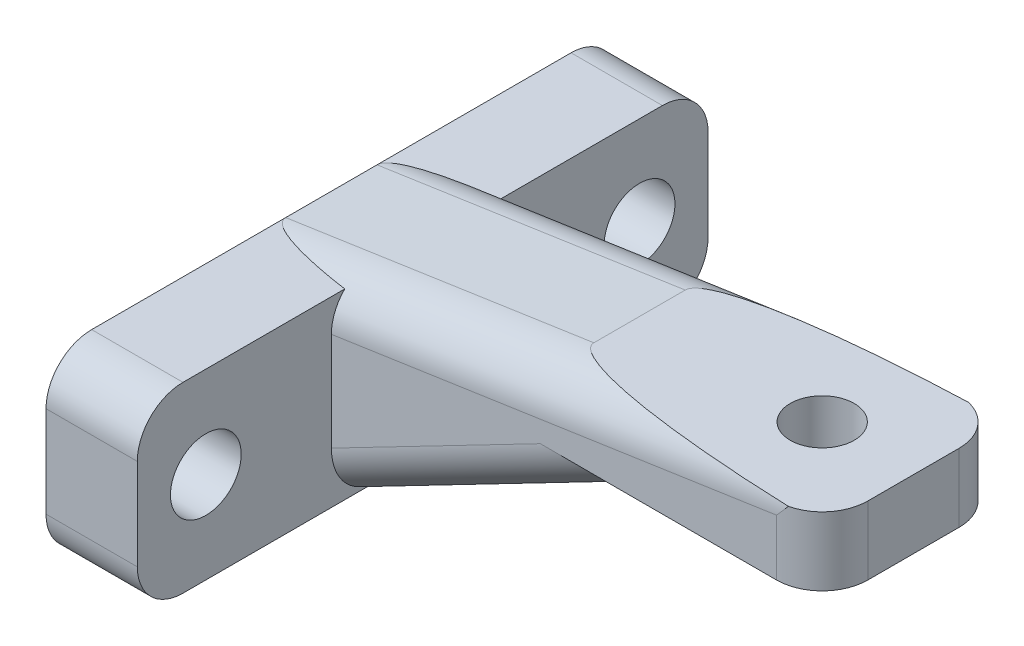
ISO-10303-21;
HEADER;
FILE_DESCRIPTION(('STEP AP214'),'2;1');
FILE_NAME('part.step','',(''),(''),'','','');
FILE_SCHEMA(('AUTOMOTIVE_DESIGN { 1 0 10303 214 1 1 1 1 }'));
ENDSEC;
DATA;
#1=APPLICATION_CONTEXT('core data for automotive mechanical design processes');
#2=APPLICATION_PROTOCOL_DEFINITION('international standard','automotive_design',2000,#1);
#3=PRODUCT_CONTEXT('',#1,'mechanical');
#4=PRODUCT('Part','Part','',(#3));
#5=PRODUCT_RELATED_PRODUCT_CATEGORY('part','',(#4));
#6=PRODUCT_DEFINITION_FORMATION('','',#4);
#7=PRODUCT_DEFINITION_CONTEXT('part definition',#1,'design');
#8=PRODUCT_DEFINITION('design','',#6,#7);
#9=PRODUCT_DEFINITION_SHAPE('','',#8);
#10=(LENGTH_UNIT() NAMED_UNIT(*) SI_UNIT(.MILLI.,.METRE.));
#11=(NAMED_UNIT(*) PLANE_ANGLE_UNIT() SI_UNIT($,.RADIAN.));
#12=(NAMED_UNIT(*) SI_UNIT($,.STERADIAN.) SOLID_ANGLE_UNIT());
#13=UNCERTAINTY_MEASURE_WITH_UNIT(LENGTH_MEASURE(1.E-05),#10,'distance_accuracy_value','');
#14=(GEOMETRIC_REPRESENTATION_CONTEXT(3) GLOBAL_UNCERTAINTY_ASSIGNED_CONTEXT((#13)) GLOBAL_UNIT_ASSIGNED_CONTEXT((#10,
#11,#12)) REPRESENTATION_CONTEXT('',''));
#15=CARTESIAN_POINT('',(0.,0.,0.));
#16=DIRECTION('',(0.,0.,1.));
#17=DIRECTION('',(1.,0.,0.));
#18=AXIS2_PLACEMENT_3D('',#15,#16,#17);
#19=CARTESIAN_POINT('',(-21.5,0.,0.));
#20=DIRECTION('',(1.,0.,0.));
#21=DIRECTION('',(0.,0.,-1.));
#22=AXIS2_PLACEMENT_3D('',#19,#20,#21);
#23=PLANE('',#22);
#24=CARTESIAN_POINT('',(-21.5,-3.,9.5));
#25=DIRECTION('',(1.,0.,0.));
#26=DIRECTION('',(0.,0.,-1.));
#27=AXIS2_PLACEMENT_3D('',#24,#25,#26);
#28=CIRCLE('',#27,1.55);
#29=CARTESIAN_POINT('',(-21.5,-3.,7.95));
#30=VERTEX_POINT('',#29);
#31=EDGE_CURVE('E566',#30,#30,#28,.T.);
#32=ORIENTED_EDGE('',*,*,#31,.T.);
#33=EDGE_LOOP('',(#32));
#34=FACE_BOUND('',#33,.T.);
#35=DIRECTION('',(0.,0.,-1.));
#36=VECTOR('',#35,1.);
#37=CARTESIAN_POINT('',(-21.5,1.,-12.5));
#38=LINE('',#37,#36);
#39=CARTESIAN_POINT('',(-21.5,1.,-2.));
#40=VERTEX_POINT('',#39);
#41=CARTESIAN_POINT('',(-21.5,1.,-10.5));
#42=VERTEX_POINT('',#41);
#43=EDGE_CURVE('E81',#40,#42,#38,.T.);
#44=ORIENTED_EDGE('',*,*,#43,.T.);
#45=CARTESIAN_POINT('',(-21.5,-1.,-10.5));
#46=DIRECTION('',(1.,0.,0.));
#47=DIRECTION('',(0.,0.,-1.));
#48=AXIS2_PLACEMENT_3D('',#45,#46,#47);
#49=CIRCLE('',#48,2.);
#50=CARTESIAN_POINT('',(-21.5,-1.,-12.5));
#51=VERTEX_POINT('',#50);
#52=EDGE_CURVE('E616',#42,#51,#49,.F.);
#53=ORIENTED_EDGE('',*,*,#52,.T.);
#54=DIRECTION('',(0.,-1.,0.));
#55=VECTOR('',#54,1.);
#56=CARTESIAN_POINT('',(-21.5,-7.,-12.5));
#57=LINE('',#56,#55);
#58=CARTESIAN_POINT('',(-21.5,-5.,-12.5));
#59=VERTEX_POINT('',#58);
#60=EDGE_CURVE('E450',#51,#59,#57,.T.);
#61=ORIENTED_EDGE('',*,*,#60,.T.);
#62=CARTESIAN_POINT('',(-21.5,-5.,-10.5));
#63=DIRECTION('',(1.,0.,0.));
#64=DIRECTION('',(0.,0.,-1.));
#65=AXIS2_PLACEMENT_3D('',#62,#63,#64);
#66=CIRCLE('',#65,2.);
#67=CARTESIAN_POINT('',(-21.5,-7.,-10.5));
#68=VERTEX_POINT('',#67);
#69=EDGE_CURVE('E619',#59,#68,#66,.F.);
#70=ORIENTED_EDGE('',*,*,#69,.T.);
#71=DIRECTION('',(0.,0.,1.));
#72=VECTOR('',#71,1.);
#73=CARTESIAN_POINT('',(-21.5,-7.,-12.5));
#74=LINE('',#73,#72);
#75=CARTESIAN_POINT('',(-21.5,-7.,10.5));
#76=VERTEX_POINT('',#75);
#77=EDGE_CURVE('E445',#68,#76,#74,.T.);
#78=ORIENTED_EDGE('',*,*,#77,.T.);
#79=CARTESIAN_POINT('',(-21.5,-5.,10.5));
#80=DIRECTION('',(1.,0.,0.));
#81=DIRECTION('',(0.,0.,-1.));
#82=AXIS2_PLACEMENT_3D('',#79,#80,#81);
#83=CIRCLE('',#82,2.);
#84=CARTESIAN_POINT('',(-21.5,-5.,12.5));
#85=VERTEX_POINT('',#84);
#86=EDGE_CURVE('E599',#76,#85,#83,.F.);
#87=ORIENTED_EDGE('',*,*,#86,.T.);
#88=DIRECTION('',(0.,1.,0.));
#89=VECTOR('',#88,1.);
#90=CARTESIAN_POINT('',(-21.5,-7.,12.5));
#91=LINE('',#90,#89);
#92=CARTESIAN_POINT('',(-21.5,-1.,12.5));
#93=VERTEX_POINT('',#92);
#94=EDGE_CURVE('E439',#85,#93,#91,.T.);
#95=ORIENTED_EDGE('',*,*,#94,.T.);
#96=CARTESIAN_POINT('',(-21.5,-1.,10.5));
#97=DIRECTION('',(1.,0.,0.));
#98=DIRECTION('',(0.,0.,-1.));
#99=AXIS2_PLACEMENT_3D('',#96,#97,#98);
#100=CIRCLE('',#99,2.);
#101=CARTESIAN_POINT('',(-21.5,1.,10.5));
#102=VERTEX_POINT('',#101);
#103=EDGE_CURVE('E624',#93,#102,#100,.F.);
#104=ORIENTED_EDGE('',*,*,#103,.T.);
#105=CARTESIAN_POINT('',(-21.5,1.,2.));
#106=VERTEX_POINT('',#105);
#107=EDGE_CURVE('E453',#102,#106,#38,.T.);
#108=ORIENTED_EDGE('',*,*,#107,.T.);
#109=DIRECTION('',(0.,0.,1.));
#110=VECTOR('',#109,1.);
#111=CARTESIAN_POINT('',(-21.5,1.,-21.6139149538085));
#112=LINE('',#111,#110);
#113=EDGE_CURVE('E464',#40,#106,#112,.T.);
#114=ORIENTED_EDGE('',*,*,#113,.F.);
#115=EDGE_LOOP('',(#44,#53,#61,#70,#78,#87,#95,#104,#108,#114));
#116=FACE_BOUND('',#115,.T.);
#117=CARTESIAN_POINT('',(-21.5,-3.,-9.5));
#118=DIRECTION('',(1.,0.,0.));
#119=DIRECTION('',(0.,0.,-1.));
#120=AXIS2_PLACEMENT_3D('',#117,#118,#119);
#121=CIRCLE('',#120,1.55);
#122=CARTESIAN_POINT('',(-21.5,-3.,-11.05));
#123=VERTEX_POINT('',#122);
#124=EDGE_CURVE('E468',#123,#123,#121,.F.);
#125=ORIENTED_EDGE('',*,*,#124,.F.);
#126=EDGE_LOOP('',(#125));
#127=FACE_BOUND('',#126,.T.);
#128=ADVANCED_FACE('F47',(#34,#116,#127),#23,.F.);
#129=CARTESIAN_POINT('',(-17.5,1.,-12.5));
#130=DIRECTION('',(0.,1.,0.));
#131=DIRECTION('',(0.,0.,1.));
#132=AXIS2_PLACEMENT_3D('',#129,#130,#131);
#133=PLANE('',#132);
#134=DIRECTION('',(0.,0.,-1.));
#135=VECTOR('',#134,1.);
#136=CARTESIAN_POINT('',(-17.5,1.,-12.5));
#137=LINE('',#136,#135);
#138=CARTESIAN_POINT('',(-17.5,1.,-3.4146216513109));
#139=VERTEX_POINT('',#138);
#140=CARTESIAN_POINT('',(-17.5,1.,-10.5));
#141=VERTEX_POINT('',#140);
#142=EDGE_CURVE('E152',#139,#141,#137,.T.);
#143=ORIENTED_EDGE('',*,*,#142,.T.);
#144=DIRECTION('',(-1.,0.,0.));
#145=VECTOR('',#144,1.);
#146=CARTESIAN_POINT('',(-17.5,1.,-10.5));
#147=LINE('',#146,#145);
#148=EDGE_CURVE('E627',#141,#42,#147,.T.);
#149=ORIENTED_EDGE('',*,*,#148,.T.);
#150=ORIENTED_EDGE('',*,*,#43,.F.);
#151=CARTESIAN_POINT('',(-7.85265593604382,1.,-2.));
#152=DIRECTION('',(0.,1.,0.));
#153=DIRECTION('',(-1.,0.,0.));
#154=AXIS2_PLACEMENT_3D('',#151,#152,#153);
#155=ELLIPSE('',#154,13.6473440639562,2.);
#156=EDGE_CURVE('E489',#40,#139,#155,.F.);
#157=ORIENTED_EDGE('',*,*,#156,.T.);
#158=EDGE_LOOP('',(#143,#149,#150,#157));
#159=FACE_BOUND('',#158,.T.);
#160=ADVANCED_FACE('F331',(#159),#133,.T.);
#161=CARTESIAN_POINT('',(0.,3.,0.));
#162=DIRECTION('',(0.,-1.,0.));
#163=DIRECTION('',(0.,0.,-1.));
#164=AXIS2_PLACEMENT_3D('',#161,#162,#163);
#165=PLANE('',#164);
#166=DIRECTION('',(0.,0.,-1.));
#167=VECTOR('',#166,1.);
#168=CARTESIAN_POINT('',(4.,3.,4.));
#169=LINE('',#168,#167);
#170=CARTESIAN_POINT('',(4.,3.,2.));
#171=VERTEX_POINT('',#170);
#172=CARTESIAN_POINT('',(4.,3.,-2.));
#173=VERTEX_POINT('',#172);
#174=EDGE_CURVE('E404',#171,#173,#169,.T.);
#175=ORIENTED_EDGE('',*,*,#174,.T.);
#176=CARTESIAN_POINT('',(2.,3.,-2.));
#177=DIRECTION('',(0.,-1.,0.));
#178=DIRECTION('',(0.,0.,-1.));
#179=AXIS2_PLACEMENT_3D('',#176,#177,#178);
#180=CIRCLE('',#179,2.);
#181=CARTESIAN_POINT('',(2.46619337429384,3.,-3.94490712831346));
#182=VERTEX_POINT('',#181);
#183=EDGE_CURVE('E282',#173,#182,#180,.F.);
#184=ORIENTED_EDGE('',*,*,#183,.T.);
#185=CARTESIAN_POINT('',(5.64734406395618,3.,-2.));
#186=DIRECTION('',(0.,-1.,0.));
#187=DIRECTION('',(-1.,0.,0.));
#188=AXIS2_PLACEMENT_3D('',#185,#186,#187);
#189=ELLIPSE('',#188,13.6473440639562,2.);
#190=CARTESIAN_POINT('',(-8.,3.,-2.));
#191=VERTEX_POINT('',#190);
#192=EDGE_CURVE('E379',#182,#191,#189,.F.);
#193=ORIENTED_EDGE('',*,*,#192,.T.);
#194=DIRECTION('',(0.,0.,1.));
#195=VECTOR('',#194,1.);
#196=CARTESIAN_POINT('',(-8.,3.,-21.6139149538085));
#197=LINE('',#196,#195);
#198=CARTESIAN_POINT('',(-8.,3.,2.));
#199=VERTEX_POINT('',#198);
#200=EDGE_CURVE('E461',#191,#199,#197,.T.);
#201=ORIENTED_EDGE('',*,*,#200,.T.);
#202=CARTESIAN_POINT('',(5.64734406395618,3.,2.));
#203=DIRECTION('',(0.,-1.,0.));
#204=DIRECTION('',(1.,0.,0.));
#205=AXIS2_PLACEMENT_3D('',#202,#203,#204);
#206=ELLIPSE('',#205,13.6473440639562,2.);
#207=CARTESIAN_POINT('',(2.46619337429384,3.,3.94490712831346));
#208=VERTEX_POINT('',#207);
#209=EDGE_CURVE('E260',#199,#208,#206,.F.);
#210=ORIENTED_EDGE('',*,*,#209,.T.);
#211=CARTESIAN_POINT('',(2.,3.,2.));
#212=DIRECTION('',(0.,-1.,0.));
#213=DIRECTION('',(0.,0.,-1.));
#214=AXIS2_PLACEMENT_3D('',#211,#212,#213);
#215=CIRCLE('',#214,2.);
#216=EDGE_CURVE('E257',#208,#171,#215,.F.);
#217=ORIENTED_EDGE('',*,*,#216,.T.);
#218=EDGE_LOOP('',(#175,#184,#193,#201,#210,#217));
#219=FACE_BOUND('',#218,.T.);
#220=CARTESIAN_POINT('',(0.,3.,0.));
#221=DIRECTION('',(0.,1.,0.));
#222=DIRECTION('',(0.,0.,1.));
#223=AXIS2_PLACEMENT_3D('',#220,#221,#222);
#224=CIRCLE('',#223,1.4);
#225=CARTESIAN_POINT('',(0.,3.,1.4));
#226=VERTEX_POINT('',#225);
#227=EDGE_CURVE('E650',#226,#226,#224,.T.);
#228=ORIENTED_EDGE('',*,*,#227,.F.);
#229=EDGE_LOOP('',(#228));
#230=FACE_BOUND('',#229,.T.);
#231=ADVANCED_FACE('F327',(#219,#230),#165,.F.);
#232=CARTESIAN_POINT('',(0.,0.,0.));
#233=DIRECTION('',(0.,-1.,0.));
#234=DIRECTION('',(0.,0.,-1.));
#235=AXIS2_PLACEMENT_3D('',#232,#233,#234);
#236=PLANE('',#235);
#237=DIRECTION('',(-1.,0.,0.));
#238=VECTOR('',#237,1.);
#239=CARTESIAN_POINT('',(-4.,0.,-4.));
#240=LINE('',#239,#238);
#241=CARTESIAN_POINT('',(2.,0.,-4.));
#242=VERTEX_POINT('',#241);
#243=CARTESIAN_POINT('',(-8.34483037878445,0.,-4.));
#244=VERTEX_POINT('',#243);
#245=EDGE_CURVE('E392',#242,#244,#240,.T.);
#246=ORIENTED_EDGE('',*,*,#245,.F.);
#247=CARTESIAN_POINT('',(2.,0.,-2.));
#248=DIRECTION('',(0.,-1.,0.));
#249=DIRECTION('',(0.,0.,-1.));
#250=AXIS2_PLACEMENT_3D('',#247,#248,#249);
#251=CIRCLE('',#250,2.);
#252=CARTESIAN_POINT('',(4.,0.,-2.));
#253=VERTEX_POINT('',#252);
#254=EDGE_CURVE('E362',#242,#253,#251,.T.);
#255=ORIENTED_EDGE('',*,*,#254,.T.);
#256=DIRECTION('',(0.,0.,-1.));
#257=VECTOR('',#256,1.);
#258=CARTESIAN_POINT('',(4.,0.,4.));
#259=LINE('',#258,#257);
#260=CARTESIAN_POINT('',(4.,0.,2.));
#261=VERTEX_POINT('',#260);
#262=EDGE_CURVE('E397',#261,#253,#259,.T.);
#263=ORIENTED_EDGE('',*,*,#262,.F.);
#264=CARTESIAN_POINT('',(2.,0.,2.));
#265=DIRECTION('',(0.,-1.,0.));
#266=DIRECTION('',(0.,0.,-1.));
#267=AXIS2_PLACEMENT_3D('',#264,#265,#266);
#268=CIRCLE('',#267,2.);
#269=CARTESIAN_POINT('',(2.,0.,4.));
#270=VERTEX_POINT('',#269);
#271=EDGE_CURVE('E358',#261,#270,#268,.T.);
#272=ORIENTED_EDGE('',*,*,#271,.T.);
#273=DIRECTION('',(1.,0.,0.));
#274=VECTOR('',#273,1.);
#275=CARTESIAN_POINT('',(-4.,0.,4.));
#276=LINE('',#275,#274);
#277=CARTESIAN_POINT('',(-8.34483037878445,0.,4.));
#278=VERTEX_POINT('',#277);
#279=EDGE_CURVE('E402',#278,#270,#276,.T.);
#280=ORIENTED_EDGE('',*,*,#279,.F.);
#281=CARTESIAN_POINT('',(-8.34483037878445,0.,2.));
#282=DIRECTION('',(0.,-1.,0.));
#283=DIRECTION('',(-1.,0.,0.));
#284=AXIS2_PLACEMENT_3D('',#281,#282,#283);
#285=ELLIPSE('',#284,4.34483037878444,2.);
#286=CARTESIAN_POINT('',(-4.,0.,2.));
#287=VERTEX_POINT('',#286);
#288=EDGE_CURVE('E188',#278,#287,#285,.F.);
#289=ORIENTED_EDGE('',*,*,#288,.T.);
#290=CARTESIAN_POINT('',(-4.,0.,-2.));
#291=DIRECTION('',(0.,0.,1.));
#292=VECTOR('',#291,1.);
#293=LINE('',#290,#292);
#294=CARTESIAN_POINT('',(-4.,0.,-2.));
#295=VERTEX_POINT('',#294);
#296=EDGE_CURVE('E356',#295,#287,#293,.T.);
#297=ORIENTED_EDGE('',*,*,#296,.F.);
#298=CARTESIAN_POINT('',(-8.34483037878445,0.,-2.));
#299=DIRECTION('',(0.,-1.,0.));
#300=DIRECTION('',(-1.,0.,0.));
#301=AXIS2_PLACEMENT_3D('',#298,#299,#300);
#302=ELLIPSE('',#301,4.34483037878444,2.);
#303=EDGE_CURVE('E59',#295,#244,#302,.F.);
#304=ORIENTED_EDGE('',*,*,#303,.T.);
#305=EDGE_LOOP('',(#246,#255,#263,#272,#280,#289,#297,#304));
#306=FACE_BOUND('',#305,.T.);
#307=CARTESIAN_POINT('',(0.,0.,0.));
#308=DIRECTION('',(0.,1.,0.));
#309=DIRECTION('',(0.,0.,1.));
#310=AXIS2_PLACEMENT_3D('',#307,#308,#309);
#311=CIRCLE('',#310,1.4);
#312=CARTESIAN_POINT('',(0.,0.,1.4));
#313=VERTEX_POINT('',#312);
#314=EDGE_CURVE('E647',#313,#313,#311,.T.);
#315=ORIENTED_EDGE('',*,*,#314,.T.);
#316=EDGE_LOOP('',(#315));
#317=FACE_BOUND('',#316,.T.);
#318=ADVANCED_FACE('F330',(#306,#317),#236,.T.);
#319=CARTESIAN_POINT('',(4.,3.,4.));
#320=DIRECTION('',(-1.,0.,0.));
#321=DIRECTION('',(0.,0.,1.));
#322=AXIS2_PLACEMENT_3D('',#319,#320,#321);
#323=PLANE('',#322);
#324=ORIENTED_EDGE('',*,*,#262,.T.);
#325=DIRECTION('',(0.,-1.,0.));
#326=VECTOR('',#325,1.);
#327=CARTESIAN_POINT('',(4.,3.,-2.));
#328=LINE('',#327,#326);
#329=EDGE_CURVE('E371',#253,#173,#328,.F.);
#330=ORIENTED_EDGE('',*,*,#329,.T.);
#331=ORIENTED_EDGE('',*,*,#174,.F.);
#332=DIRECTION('',(0.,-1.,0.));
#333=VECTOR('',#332,1.);
#334=CARTESIAN_POINT('',(4.,3.,2.));
#335=LINE('',#334,#333);
#336=EDGE_CURVE('E367',#171,#261,#335,.T.);
#337=ORIENTED_EDGE('',*,*,#336,.T.);
#338=EDGE_LOOP('',(#324,#330,#331,#337));
#339=FACE_BOUND('',#338,.T.);
#340=ADVANCED_FACE('F335',(#339),#323,.F.);
#341=CARTESIAN_POINT('',(-4.,3.,-4.));
#342=DIRECTION('',(0.,0.,1.));
#343=DIRECTION('',(1.,0.,0.));
#344=AXIS2_PLACEMENT_3D('',#341,#342,#343);
#345=PLANE('',#344);
#346=DIRECTION('',(0.989203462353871,0.146548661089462,0.));
#347=VECTOR('',#346,1.);
#348=CARTESIAN_POINT('',(-7.70690267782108,1.02159307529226,-4.));
#349=LINE('',#348,#347);
#350=CARTESIAN_POINT('',(-17.5,-0.429236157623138,-4.00000000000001));
#351=VERTEX_POINT('',#350);
#352=CARTESIAN_POINT('',(2.,2.45965273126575,-4.));
#353=VERTEX_POINT('',#352);
#354=EDGE_CURVE('E510',#351,#353,#349,.T.);
#355=ORIENTED_EDGE('',*,*,#354,.T.);
#356=DIRECTION('',(0.,-1.,0.));
#357=VECTOR('',#356,1.);
#358=CARTESIAN_POINT('',(2.,3.,-4.));
#359=LINE('',#358,#357);
#360=EDGE_CURVE('E363',#353,#242,#359,.T.);
#361=ORIENTED_EDGE('',*,*,#360,.T.);
#362=ORIENTED_EDGE('',*,*,#245,.T.);
#363=DIRECTION('',(0.88775453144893,0.460317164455,0.));
#364=VECTOR('',#363,1.);
#365=CARTESIAN_POINT('',(-18.42063432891,-5.22449093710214,-4.));
#366=LINE('',#365,#364);
#367=CARTESIAN_POINT('',(-17.5,-4.74712498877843,-4.00000000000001));
#368=VERTEX_POINT('',#367);
#369=EDGE_CURVE('E408',#244,#368,#366,.F.);
#370=ORIENTED_EDGE('',*,*,#369,.T.);
#371=DIRECTION('',(0.,1.,0.));
#372=VECTOR('',#371,1.);
#373=CARTESIAN_POINT('',(-17.5,-7.,-4.00000000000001));
#374=LINE('',#373,#372);
#375=EDGE_CURVE('E386',#368,#351,#374,.T.);
#376=ORIENTED_EDGE('',*,*,#375,.T.);
#377=EDGE_LOOP('',(#355,#361,#362,#370,#376));
#378=FACE_BOUND('',#377,.T.);
#379=ADVANCED_FACE('F507',(#378),#345,.F.);
#380=CARTESIAN_POINT('',(-4.,3.,4.));
#381=DIRECTION('',(0.,0.,-1.));
#382=DIRECTION('',(-1.,0.,0.));
#383=AXIS2_PLACEMENT_3D('',#380,#381,#382);
#384=PLANE('',#383);
#385=ORIENTED_EDGE('',*,*,#279,.T.);
#386=DIRECTION('',(0.,-1.,0.));
#387=VECTOR('',#386,1.);
#388=CARTESIAN_POINT('',(2.,3.,4.));
#389=LINE('',#388,#387);
#390=CARTESIAN_POINT('',(2.,2.45965273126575,4.));
#391=VERTEX_POINT('',#390);
#392=EDGE_CURVE('E93',#270,#391,#389,.F.);
#393=ORIENTED_EDGE('',*,*,#392,.T.);
#394=DIRECTION('',(-0.989203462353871,-0.146548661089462,0.));
#395=VECTOR('',#394,1.);
#396=CARTESIAN_POINT('',(-21.2069026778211,-0.978406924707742,4.));
#397=LINE('',#396,#395);
#398=CARTESIAN_POINT('',(-17.5,-0.429236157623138,3.99999999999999));
#399=VERTEX_POINT('',#398);
#400=EDGE_CURVE('E261',#391,#399,#397,.T.);
#401=ORIENTED_EDGE('',*,*,#400,.T.);
#402=DIRECTION('',(0.,1.,0.));
#403=VECTOR('',#402,1.);
#404=CARTESIAN_POINT('',(-17.5,-7.,3.99999999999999));
#405=LINE('',#404,#403);
#406=CARTESIAN_POINT('',(-17.5,-4.74712498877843,3.99999999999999));
#407=VERTEX_POINT('',#406);
#408=EDGE_CURVE('E178',#407,#399,#405,.T.);
#409=ORIENTED_EDGE('',*,*,#408,.F.);
#410=DIRECTION('',(0.88775453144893,0.460317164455,0.));
#411=VECTOR('',#410,1.);
#412=CARTESIAN_POINT('',(-4.92063432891,1.77550906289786,4.));
#413=LINE('',#412,#411);
#414=EDGE_CURVE('E277',#407,#278,#413,.T.);
#415=ORIENTED_EDGE('',*,*,#414,.T.);
#416=EDGE_LOOP('',(#385,#393,#401,#409,#415));
#417=FACE_BOUND('',#416,.T.);
#418=ADVANCED_FACE('F273',(#417),#384,.F.);
#419=CARTESIAN_POINT('',(0.,3.,0.));
#420=DIRECTION('',(0.,-1.,0.));
#421=DIRECTION('',(0.,0.,-1.));
#422=AXIS2_PLACEMENT_3D('',#419,#420,#421);
#423=CYLINDRICAL_SURFACE('',#422,1.4);
#424=ORIENTED_EDGE('',*,*,#227,.T.);
#425=EDGE_LOOP('',(#424));
#426=FACE_BOUND('',#425,.T.);
#427=ORIENTED_EDGE('',*,*,#314,.F.);
#428=EDGE_LOOP('',(#427));
#429=FACE_BOUND('',#428,.T.);
#430=ADVANCED_FACE('F320',(#426,#429),#423,.F.);
#431=CARTESIAN_POINT('',(-0.847567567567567,1.63459459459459,0.));
#432=DIRECTION('',(0.460317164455,-0.88775453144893,0.));
#433=DIRECTION('',(0.88775453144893,0.460317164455,0.));
#434=AXIS2_PLACEMENT_3D('',#431,#432,#433);
#435=PLANE('',#434);
#436=ORIENTED_EDGE('',*,*,#296,.T.);
#437=DIRECTION('',(0.88775453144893,0.460317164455,0.));
#438=VECTOR('',#437,1.);
#439=CARTESIAN_POINT('',(-17.5,-7.,2.));
#440=LINE('',#439,#438);
#441=CARTESIAN_POINT('',(-17.5,-7.,2.));
#442=VERTEX_POINT('',#441);
#443=EDGE_CURVE('E411',#287,#442,#440,.F.);
#444=ORIENTED_EDGE('',*,*,#443,.T.);
#445=DIRECTION('',(0.,0.,-1.));
#446=VECTOR('',#445,1.);
#447=CARTESIAN_POINT('',(-17.5,-7.,3.99999999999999));
#448=LINE('',#447,#446);
#449=CARTESIAN_POINT('',(-17.5,-7.,-2.));
#450=VERTEX_POINT('',#449);
#451=EDGE_CURVE('E51',#442,#450,#448,.T.);
#452=ORIENTED_EDGE('',*,*,#451,.T.);
#453=DIRECTION('',(0.88775453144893,0.460317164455,0.));
#454=VECTOR('',#453,1.);
#455=CARTESIAN_POINT('',(-4.,0.,-2.));
#456=LINE('',#455,#454);
#457=EDGE_CURVE('E291',#450,#295,#456,.T.);
#458=ORIENTED_EDGE('',*,*,#457,.T.);
#459=EDGE_LOOP('',(#436,#444,#452,#458));
#460=FACE_BOUND('',#459,.T.);
#461=ADVANCED_FACE('F310',(#460),#435,.T.);
#462=CARTESIAN_POINT('',(-17.5,0.,0.));
#463=DIRECTION('',(1.,0.,0.));
#464=DIRECTION('',(0.,0.,-1.));
#465=AXIS2_PLACEMENT_3D('',#462,#463,#464);
#466=PLANE('',#465);
#467=CARTESIAN_POINT('',(-17.5,-3.,9.5));
#468=DIRECTION('',(1.,0.,0.));
#469=DIRECTION('',(0.,0.,-1.));
#470=AXIS2_PLACEMENT_3D('',#467,#468,#469);
#471=CIRCLE('',#470,1.55);
#472=CARTESIAN_POINT('',(-17.5,-3.,7.95));
#473=VERTEX_POINT('',#472);
#474=EDGE_CURVE('E244',#473,#473,#471,.T.);
#475=ORIENTED_EDGE('',*,*,#474,.F.);
#476=EDGE_LOOP('',(#475));
#477=FACE_BOUND('',#476,.T.);
#478=DIRECTION('',(0.,1.,0.));
#479=VECTOR('',#478,1.);
#480=CARTESIAN_POINT('',(-17.5,-7.,12.5));
#481=LINE('',#480,#479);
#482=CARTESIAN_POINT('',(-17.5,-5.,12.5));
#483=VERTEX_POINT('',#482);
#484=CARTESIAN_POINT('',(-17.5,-1.,12.5));
#485=VERTEX_POINT('',#484);
#486=EDGE_CURVE('E449',#483,#485,#481,.T.);
#487=ORIENTED_EDGE('',*,*,#486,.F.);
#488=CARTESIAN_POINT('',(-17.5,-5.,10.5));
#489=DIRECTION('',(1.,0.,0.));
#490=DIRECTION('',(0.,0.,-1.));
#491=AXIS2_PLACEMENT_3D('',#488,#489,#490);
#492=CIRCLE('',#491,2.);
#493=CARTESIAN_POINT('',(-17.5,-7.,10.5));
#494=VERTEX_POINT('',#493);
#495=EDGE_CURVE('E484',#483,#494,#492,.T.);
#496=ORIENTED_EDGE('',*,*,#495,.T.);
#497=DIRECTION('',(0.,0.,1.));
#498=VECTOR('',#497,1.);
#499=CARTESIAN_POINT('',(-17.5,-7.,-12.5));
#500=LINE('',#499,#498);
#501=CARTESIAN_POINT('',(-17.5,-7.,3.99999999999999));
#502=VERTEX_POINT('',#501);
#503=EDGE_CURVE('E434',#502,#494,#500,.T.);
#504=ORIENTED_EDGE('',*,*,#503,.F.);
#505=CARTESIAN_POINT('',(-17.5,-7.,3.99999999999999));
#506=DIRECTION('',(0.,0.,-1.));
#507=VECTOR('',#506,1.);
#508=LINE('',#505,#507);
#509=EDGE_CURVE('E212',#502,#442,#508,.T.);
#510=ORIENTED_EDGE('',*,*,#509,.T.);
#511=CARTESIAN_POINT('',(-17.5,-4.74712498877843,2.));
#512=DIRECTION('',(1.,0.,0.));
#513=DIRECTION('',(0.,-1.,0.));
#514=AXIS2_PLACEMENT_3D('',#511,#512,#513);
#515=ELLIPSE('',#514,2.25287501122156,2.);
#516=EDGE_CURVE('E192',#442,#407,#515,.F.);
#517=ORIENTED_EDGE('',*,*,#516,.T.);
#518=ORIENTED_EDGE('',*,*,#408,.T.);
#519=CARTESIAN_POINT('',(-17.5,-0.429236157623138,2.));
#520=DIRECTION('',(1.,0.,0.));
#521=DIRECTION('',(0.,1.,0.));
#522=AXIS2_PLACEMENT_3D('',#519,#520,#521);
#523=ELLIPSE('',#522,2.02182875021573,2.);
#524=CARTESIAN_POINT('',(-17.5,1.,3.4146216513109));
#525=VERTEX_POINT('',#524);
#526=EDGE_CURVE('E173',#399,#525,#523,.F.);
#527=ORIENTED_EDGE('',*,*,#526,.T.);
#528=CARTESIAN_POINT('',(-17.5,1.,10.5));
#529=VERTEX_POINT('',#528);
#530=EDGE_CURVE('E157',#529,#525,#137,.T.);
#531=ORIENTED_EDGE('',*,*,#530,.F.);
#532=CARTESIAN_POINT('',(-17.5,-1.,10.5));
#533=DIRECTION('',(1.,0.,0.));
#534=DIRECTION('',(0.,0.,-1.));
#535=AXIS2_PLACEMENT_3D('',#532,#533,#534);
#536=CIRCLE('',#535,2.);
#537=EDGE_CURVE('E481',#529,#485,#536,.T.);
#538=ORIENTED_EDGE('',*,*,#537,.T.);
#539=EDGE_LOOP('',(#487,#496,#504,#510,#517,#518,#527,#531,#538));
#540=FACE_BOUND('',#539,.T.);
#541=ADVANCED_FACE('F175',(#477,#540),#466,.T.);
#542=CARTESIAN_POINT('',(-17.5,-7.,12.5));
#543=DIRECTION('',(0.,0.,1.));
#544=DIRECTION('',(1.,0.,0.));
#545=AXIS2_PLACEMENT_3D('',#542,#543,#544);
#546=PLANE('',#545);
#547=ORIENTED_EDGE('',*,*,#94,.F.);
#548=DIRECTION('',(-1.,0.,0.));
#549=VECTOR('',#548,1.);
#550=CARTESIAN_POINT('',(-17.5,-5.,12.5));
#551=LINE('',#550,#549);
#552=EDGE_CURVE('E479',#85,#483,#551,.F.);
#553=ORIENTED_EDGE('',*,*,#552,.T.);
#554=ORIENTED_EDGE('',*,*,#486,.T.);
#555=DIRECTION('',(-1.,0.,0.));
#556=VECTOR('',#555,1.);
#557=CARTESIAN_POINT('',(-17.5,-1.,12.5));
#558=LINE('',#557,#556);
#559=EDGE_CURVE('E594',#485,#93,#558,.T.);
#560=ORIENTED_EDGE('',*,*,#559,.T.);
#561=EDGE_LOOP('',(#547,#553,#554,#560));
#562=FACE_BOUND('',#561,.T.);
#563=ADVANCED_FACE('F321',(#562),#546,.T.);
#564=CARTESIAN_POINT('',(-17.5,-7.,-12.5));
#565=DIRECTION('',(0.,-1.,0.));
#566=DIRECTION('',(0.,0.,-1.));
#567=AXIS2_PLACEMENT_3D('',#564,#565,#566);
#568=PLANE('',#567);
#569=ORIENTED_EDGE('',*,*,#77,.F.);
#570=DIRECTION('',(-1.,0.,0.));
#571=VECTOR('',#570,1.);
#572=CARTESIAN_POINT('',(-17.5,-7.,-10.5));
#573=LINE('',#572,#571);
#574=CARTESIAN_POINT('',(-17.5,-7.,-10.5));
#575=VERTEX_POINT('',#574);
#576=EDGE_CURVE('E424',#68,#575,#573,.F.);
#577=ORIENTED_EDGE('',*,*,#576,.T.);
#578=CARTESIAN_POINT('',(-17.5,-7.,-4.00000000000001));
#579=VERTEX_POINT('',#578);
#580=EDGE_CURVE('E387',#575,#579,#500,.T.);
#581=ORIENTED_EDGE('',*,*,#580,.T.);
#582=CARTESIAN_POINT('',(-17.5,-7.,-2.));
#583=DIRECTION('',(0.,0.,-1.));
#584=VECTOR('',#583,1.);
#585=LINE('',#582,#584);
#586=EDGE_CURVE('E66',#450,#579,#585,.T.);
#587=ORIENTED_EDGE('',*,*,#586,.F.);
#588=ORIENTED_EDGE('',*,*,#451,.F.);
#589=ORIENTED_EDGE('',*,*,#509,.F.);
#590=ORIENTED_EDGE('',*,*,#503,.T.);
#591=DIRECTION('',(-1.,0.,0.));
#592=VECTOR('',#591,1.);
#593=CARTESIAN_POINT('',(-17.5,-7.,10.5));
#594=LINE('',#593,#592);
#595=EDGE_CURVE('E419',#494,#76,#594,.T.);
#596=ORIENTED_EDGE('',*,*,#595,.T.);
#597=EDGE_LOOP('',(#569,#577,#581,#587,#588,#589,#590,#596));
#598=FACE_BOUND('',#597,.T.);
#599=ADVANCED_FACE('F539',(#598),#568,.T.);
#600=CARTESIAN_POINT('',(-17.5,-7.,-12.5));
#601=DIRECTION('',(0.,0.,-1.));
#602=DIRECTION('',(-1.,0.,0.));
#603=AXIS2_PLACEMENT_3D('',#600,#601,#602);
#604=PLANE('',#603);
#605=ORIENTED_EDGE('',*,*,#60,.F.);
#606=DIRECTION('',(-1.,0.,0.));
#607=VECTOR('',#606,1.);
#608=CARTESIAN_POINT('',(-17.5,-1.,-12.5));
#609=LINE('',#608,#607);
#610=CARTESIAN_POINT('',(-17.5,-1.,-12.5));
#611=VERTEX_POINT('',#610);
#612=EDGE_CURVE('E609',#51,#611,#609,.F.);
#613=ORIENTED_EDGE('',*,*,#612,.T.);
#614=DIRECTION('',(0.,-1.,0.));
#615=VECTOR('',#614,1.);
#616=CARTESIAN_POINT('',(-17.5,-7.,-12.5));
#617=LINE('',#616,#615);
#618=CARTESIAN_POINT('',(-17.5,-5.,-12.5));
#619=VERTEX_POINT('',#618);
#620=EDGE_CURVE('E169',#611,#619,#617,.T.);
#621=ORIENTED_EDGE('',*,*,#620,.T.);
#622=DIRECTION('',(-1.,0.,0.));
#623=VECTOR('',#622,1.);
#624=CARTESIAN_POINT('',(-17.5,-5.,-12.5));
#625=LINE('',#624,#623);
#626=EDGE_CURVE('E612',#619,#59,#625,.T.);
#627=ORIENTED_EDGE('',*,*,#626,.T.);
#628=EDGE_LOOP('',(#605,#613,#621,#627));
#629=FACE_BOUND('',#628,.T.);
#630=ADVANCED_FACE('F553',(#629),#604,.T.);
#631=ORIENTED_EDGE('',*,*,#107,.F.);
#632=DIRECTION('',(-1.,0.,0.));
#633=VECTOR('',#632,1.);
#634=CARTESIAN_POINT('',(-17.5,1.,10.5));
#635=LINE('',#634,#633);
#636=EDGE_CURVE('E165',#102,#529,#635,.F.);
#637=ORIENTED_EDGE('',*,*,#636,.T.);
#638=ORIENTED_EDGE('',*,*,#530,.T.);
#639=CARTESIAN_POINT('',(-7.85265593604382,1.,2.));
#640=DIRECTION('',(0.,1.,0.));
#641=DIRECTION('',(1.,0.,0.));
#642=AXIS2_PLACEMENT_3D('',#639,#640,#641);
#643=ELLIPSE('',#642,13.6473440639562,2.);
#644=EDGE_CURVE('E162',#525,#106,#643,.F.);
#645=ORIENTED_EDGE('',*,*,#644,.T.);
#646=EDGE_LOOP('',(#631,#637,#638,#645));
#647=FACE_BOUND('',#646,.T.);
#648=ADVANCED_FACE('F160',(#647),#133,.T.);
#649=CARTESIAN_POINT('',(-17.5,-3.,-9.5));
#650=DIRECTION('',(1.,0.,0.));
#651=DIRECTION('',(0.,0.,-1.));
#652=AXIS2_PLACEMENT_3D('',#649,#650,#651);
#653=CIRCLE('',#652,1.55);
#654=CARTESIAN_POINT('',(-17.5,-3.,-11.05));
#655=VERTEX_POINT('',#654);
#656=EDGE_CURVE('E572',#655,#655,#653,.F.);
#657=ORIENTED_EDGE('',*,*,#656,.T.);
#658=EDGE_LOOP('',(#657));
#659=FACE_BOUND('',#658,.T.);
#660=ORIENTED_EDGE('',*,*,#620,.F.);
#661=CARTESIAN_POINT('',(-17.5,-1.,-10.5));
#662=DIRECTION('',(1.,0.,0.));
#663=DIRECTION('',(0.,0.,-1.));
#664=AXIS2_PLACEMENT_3D('',#661,#662,#663);
#665=CIRCLE('',#664,2.);
#666=EDGE_CURVE('E602',#611,#141,#665,.T.);
#667=ORIENTED_EDGE('',*,*,#666,.T.);
#668=ORIENTED_EDGE('',*,*,#142,.F.);
#669=CARTESIAN_POINT('',(-17.5,-0.429236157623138,-2.));
#670=DIRECTION('',(1.,0.,0.));
#671=DIRECTION('',(0.,-1.,0.));
#672=AXIS2_PLACEMENT_3D('',#669,#670,#671);
#673=ELLIPSE('',#672,2.02182875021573,2.);
#674=EDGE_CURVE('E181',#139,#351,#673,.F.);
#675=ORIENTED_EDGE('',*,*,#674,.T.);
#676=ORIENTED_EDGE('',*,*,#375,.F.);
#677=CARTESIAN_POINT('',(-17.5,-4.74712498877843,-2.));
#678=DIRECTION('',(1.,0.,0.));
#679=DIRECTION('',(0.,-1.,0.));
#680=AXIS2_PLACEMENT_3D('',#677,#678,#679);
#681=ELLIPSE('',#680,2.25287501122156,2.);
#682=EDGE_CURVE('E12',#368,#450,#681,.F.);
#683=ORIENTED_EDGE('',*,*,#682,.T.);
#684=ORIENTED_EDGE('',*,*,#586,.T.);
#685=ORIENTED_EDGE('',*,*,#580,.F.);
#686=CARTESIAN_POINT('',(-17.5,-5.,-10.5));
#687=DIRECTION('',(1.,0.,0.));
#688=DIRECTION('',(0.,0.,-1.));
#689=AXIS2_PLACEMENT_3D('',#686,#687,#688);
#690=CIRCLE('',#689,2.);
#691=EDGE_CURVE('E604',#575,#619,#690,.T.);
#692=ORIENTED_EDGE('',*,*,#691,.T.);
#693=EDGE_LOOP('',(#660,#667,#668,#675,#676,#683,#684,#685,#692));
#694=FACE_BOUND('',#693,.T.);
#695=ADVANCED_FACE('F218',(#659,#694),#466,.T.);
#696=CARTESIAN_POINT('',(-8.,3.,-21.6139149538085));
#697=DIRECTION('',(-0.146548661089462,0.989203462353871,0.));
#698=DIRECTION('',(-0.989203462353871,-0.146548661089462,0.));
#699=AXIS2_PLACEMENT_3D('',#696,#697,#698);
#700=PLANE('',#699);
#701=ORIENTED_EDGE('',*,*,#200,.F.);
#702=DIRECTION('',(0.989203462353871,0.146548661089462,0.));
#703=VECTOR('',#702,1.);
#704=CARTESIAN_POINT('',(-21.5,0.999999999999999,-2.));
#705=LINE('',#704,#703);
#706=EDGE_CURVE('E288',#191,#40,#705,.F.);
#707=ORIENTED_EDGE('',*,*,#706,.T.);
#708=ORIENTED_EDGE('',*,*,#113,.T.);
#709=DIRECTION('',(-0.989203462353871,-0.146548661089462,0.));
#710=VECTOR('',#709,1.);
#711=CARTESIAN_POINT('',(-8.,3.,2.));
#712=LINE('',#711,#710);
#713=EDGE_CURVE('E186',#106,#199,#712,.F.);
#714=ORIENTED_EDGE('',*,*,#713,.T.);
#715=EDGE_LOOP('',(#701,#707,#708,#714));
#716=FACE_BOUND('',#715,.T.);
#717=ADVANCED_FACE('F228',(#716),#700,.T.);
#718=CARTESIAN_POINT('',(-21.5,-3.,9.5));
#719=DIRECTION('',(1.,0.,0.));
#720=DIRECTION('',(0.,0.,-1.));
#721=AXIS2_PLACEMENT_3D('',#718,#719,#720);
#722=CYLINDRICAL_SURFACE('',#721,1.55);
#723=ORIENTED_EDGE('',*,*,#31,.F.);
#724=EDGE_LOOP('',(#723));
#725=FACE_BOUND('',#724,.T.);
#726=ORIENTED_EDGE('',*,*,#474,.T.);
#727=EDGE_LOOP('',(#726));
#728=FACE_BOUND('',#727,.T.);
#729=ADVANCED_FACE('F582',(#725,#728),#722,.F.);
#730=CARTESIAN_POINT('',(-21.5,-3.,-9.5));
#731=DIRECTION('',(1.,0.,0.));
#732=DIRECTION('',(0.,0.,-1.));
#733=AXIS2_PLACEMENT_3D('',#730,#731,#732);
#734=CYLINDRICAL_SURFACE('',#733,1.55);
#735=ORIENTED_EDGE('',*,*,#124,.T.);
#736=EDGE_LOOP('',(#735));
#737=FACE_BOUND('',#736,.T.);
#738=ORIENTED_EDGE('',*,*,#656,.F.);
#739=EDGE_LOOP('',(#738));
#740=FACE_BOUND('',#739,.T.);
#741=ADVANCED_FACE('F670',(#737,#740),#734,.F.);
#742=CARTESIAN_POINT('',(-3.79280871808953,1.60145884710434,-2.));
#743=DIRECTION('',(-0.989203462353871,-0.146548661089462,0.));
#744=DIRECTION('',(0.146548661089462,-0.989203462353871,0.));
#745=AXIS2_PLACEMENT_3D('',#742,#743,#744);
#746=CYLINDRICAL_SURFACE('',#745,2.);
#747=ORIENTED_EDGE('',*,*,#706,.F.);
#748=ORIENTED_EDGE('',*,*,#192,.F.);
#749=CARTESIAN_POINT('',(2.,2.45965273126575,-2.));
#750=DIRECTION('',(0.757148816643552,-0.653242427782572,0.));
#751=DIRECTION('',(-0.653242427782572,-0.757148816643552,0.));
#752=AXIS2_PLACEMENT_3D('',#749,#750,#751);
#753=ELLIPSE('',#752,3.0616504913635,2.);
#754=EDGE_CURVE('E236',#353,#182,#753,.T.);
#755=ORIENTED_EDGE('',*,*,#754,.F.);
#756=ORIENTED_EDGE('',*,*,#354,.F.);
#757=ORIENTED_EDGE('',*,*,#674,.F.);
#758=ORIENTED_EDGE('',*,*,#156,.F.);
#759=EDGE_LOOP('',(#747,#748,#755,#756,#757,#758));
#760=FACE_BOUND('',#759,.T.);
#761=ADVANCED_FACE('F515',(#760),#746,.T.);
#762=CARTESIAN_POINT('',(2.,3.,-2.));
#763=DIRECTION('',(0.,-1.,0.));
#764=DIRECTION('',(0.,0.,-1.));
#765=AXIS2_PLACEMENT_3D('',#762,#763,#764);
#766=CYLINDRICAL_SURFACE('',#765,2.);
#767=ORIENTED_EDGE('',*,*,#183,.F.);
#768=ORIENTED_EDGE('',*,*,#329,.F.);
#769=ORIENTED_EDGE('',*,*,#254,.F.);
#770=ORIENTED_EDGE('',*,*,#360,.F.);
#771=ORIENTED_EDGE('',*,*,#754,.T.);
#772=EDGE_LOOP('',(#767,#768,#769,#770,#771));
#773=FACE_BOUND('',#772,.T.);
#774=ADVANCED_FACE('F662',(#773),#766,.T.);
#775=CARTESIAN_POINT('',(-3.79280871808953,1.60145884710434,2.));
#776=DIRECTION('',(0.989203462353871,0.146548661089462,0.));
#777=DIRECTION('',(-0.146548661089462,0.989203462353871,0.));
#778=AXIS2_PLACEMENT_3D('',#775,#776,#777);
#779=CYLINDRICAL_SURFACE('',#778,2.);
#780=ORIENTED_EDGE('',*,*,#526,.F.);
#781=ORIENTED_EDGE('',*,*,#400,.F.);
#782=CARTESIAN_POINT('',(2.,2.45965273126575,2.));
#783=DIRECTION('',(0.757148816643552,-0.653242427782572,0.));
#784=DIRECTION('',(0.653242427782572,0.757148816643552,0.));
#785=AXIS2_PLACEMENT_3D('',#782,#783,#784);
#786=ELLIPSE('',#785,3.0616504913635,2.);
#787=EDGE_CURVE('E245',#208,#391,#786,.T.);
#788=ORIENTED_EDGE('',*,*,#787,.F.);
#789=ORIENTED_EDGE('',*,*,#209,.F.);
#790=ORIENTED_EDGE('',*,*,#713,.F.);
#791=ORIENTED_EDGE('',*,*,#644,.F.);
#792=EDGE_LOOP('',(#780,#781,#788,#789,#790,#791));
#793=FACE_BOUND('',#792,.T.);
#794=ADVANCED_FACE('F183',(#793),#779,.T.);
#795=CARTESIAN_POINT('',(2.,3.,2.));
#796=DIRECTION('',(0.,-1.,0.));
#797=DIRECTION('',(0.,0.,-1.));
#798=AXIS2_PLACEMENT_3D('',#795,#796,#797);
#799=CYLINDRICAL_SURFACE('',#798,2.);
#800=ORIENTED_EDGE('',*,*,#787,.T.);
#801=ORIENTED_EDGE('',*,*,#392,.F.);
#802=ORIENTED_EDGE('',*,*,#271,.F.);
#803=ORIENTED_EDGE('',*,*,#336,.F.);
#804=ORIENTED_EDGE('',*,*,#216,.F.);
#805=EDGE_LOOP('',(#800,#801,#802,#803,#804));
#806=FACE_BOUND('',#805,.T.);
#807=ADVANCED_FACE('F251',(#806),#799,.T.);
#808=CARTESIAN_POINT('',(-3.69468838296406,2.41118473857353,2.));
#809=DIRECTION('',(-0.88775453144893,-0.460317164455,0.));
#810=DIRECTION('',(0.460317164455,-0.88775453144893,0.));
#811=AXIS2_PLACEMENT_3D('',#808,#809,#810);
#812=CYLINDRICAL_SURFACE('',#811,2.);
#813=ORIENTED_EDGE('',*,*,#516,.F.);
#814=ORIENTED_EDGE('',*,*,#443,.F.);
#815=ORIENTED_EDGE('',*,*,#288,.F.);
#816=ORIENTED_EDGE('',*,*,#414,.F.);
#817=EDGE_LOOP('',(#813,#814,#815,#816));
#818=FACE_BOUND('',#817,.T.);
#819=ADVANCED_FACE('F417',(#818),#812,.T.);
#820=CARTESIAN_POINT('',(-1.76820189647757,3.41010365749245,-2.));
#821=DIRECTION('',(-0.88775453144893,-0.460317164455,0.));
#822=DIRECTION('',(0.460317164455,-0.88775453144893,0.));
#823=AXIS2_PLACEMENT_3D('',#820,#821,#822);
#824=CYLINDRICAL_SURFACE('',#823,2.);
#825=ORIENTED_EDGE('',*,*,#682,.F.);
#826=ORIENTED_EDGE('',*,*,#369,.F.);
#827=ORIENTED_EDGE('',*,*,#303,.F.);
#828=ORIENTED_EDGE('',*,*,#457,.F.);
#829=EDGE_LOOP('',(#825,#826,#827,#828));
#830=FACE_BOUND('',#829,.T.);
#831=ADVANCED_FACE('F535',(#830),#824,.T.);
#832=CARTESIAN_POINT('',(-17.5,-1.,-10.5));
#833=DIRECTION('',(-1.,0.,0.));
#834=DIRECTION('',(0.,0.,1.));
#835=AXIS2_PLACEMENT_3D('',#832,#833,#834);
#836=CYLINDRICAL_SURFACE('',#835,2.);
#837=ORIENTED_EDGE('',*,*,#666,.F.);
#838=ORIENTED_EDGE('',*,*,#612,.F.);
#839=ORIENTED_EDGE('',*,*,#52,.F.);
#840=ORIENTED_EDGE('',*,*,#148,.F.);
#841=EDGE_LOOP('',(#837,#838,#839,#840));
#842=FACE_BOUND('',#841,.T.);
#843=ADVANCED_FACE('F641',(#842),#836,.T.);
#844=CARTESIAN_POINT('',(-17.5,-5.,-10.5));
#845=DIRECTION('',(-1.,0.,0.));
#846=DIRECTION('',(0.,0.,1.));
#847=AXIS2_PLACEMENT_3D('',#844,#845,#846);
#848=CYLINDRICAL_SURFACE('',#847,2.);
#849=ORIENTED_EDGE('',*,*,#691,.F.);
#850=ORIENTED_EDGE('',*,*,#576,.F.);
#851=ORIENTED_EDGE('',*,*,#69,.F.);
#852=ORIENTED_EDGE('',*,*,#626,.F.);
#853=EDGE_LOOP('',(#849,#850,#851,#852));
#854=FACE_BOUND('',#853,.T.);
#855=ADVANCED_FACE('F635',(#854),#848,.T.);
#856=CARTESIAN_POINT('',(-17.5,-5.,10.5));
#857=DIRECTION('',(-1.,0.,0.));
#858=DIRECTION('',(0.,0.,1.));
#859=AXIS2_PLACEMENT_3D('',#856,#857,#858);
#860=CYLINDRICAL_SURFACE('',#859,2.);
#861=ORIENTED_EDGE('',*,*,#495,.F.);
#862=ORIENTED_EDGE('',*,*,#552,.F.);
#863=ORIENTED_EDGE('',*,*,#86,.F.);
#864=ORIENTED_EDGE('',*,*,#595,.F.);
#865=EDGE_LOOP('',(#861,#862,#863,#864));
#866=FACE_BOUND('',#865,.T.);
#867=ADVANCED_FACE('F597',(#866),#860,.T.);
#868=CARTESIAN_POINT('',(-17.5,-1.,10.5));
#869=DIRECTION('',(-1.,0.,0.));
#870=DIRECTION('',(0.,0.,1.));
#871=AXIS2_PLACEMENT_3D('',#868,#869,#870);
#872=CYLINDRICAL_SURFACE('',#871,2.);
#873=ORIENTED_EDGE('',*,*,#537,.F.);
#874=ORIENTED_EDGE('',*,*,#636,.F.);
#875=ORIENTED_EDGE('',*,*,#103,.F.);
#876=ORIENTED_EDGE('',*,*,#559,.F.);
#877=EDGE_LOOP('',(#873,#874,#875,#876));
#878=FACE_BOUND('',#877,.T.);
#879=ADVANCED_FACE('F49',(#878),#872,.T.);
#880=CLOSED_SHELL('',(#128,#160,#231,#318,#340,#379,#418,#430,#461,#541,#563,#599,#630,#648,
#695,#717,#729,#741,#761,#774,#794,#807,#819,#831,#843,#855,#867,#879));
#881=MANIFOLD_SOLID_BREP('B2',#880);
#882=ADVANCED_BREP_SHAPE_REPRESENTATION('',(#18,#881),#14);
#883=SHAPE_DEFINITION_REPRESENTATION(#9,#882);
ENDSEC;
END-ISO-10303-21;
